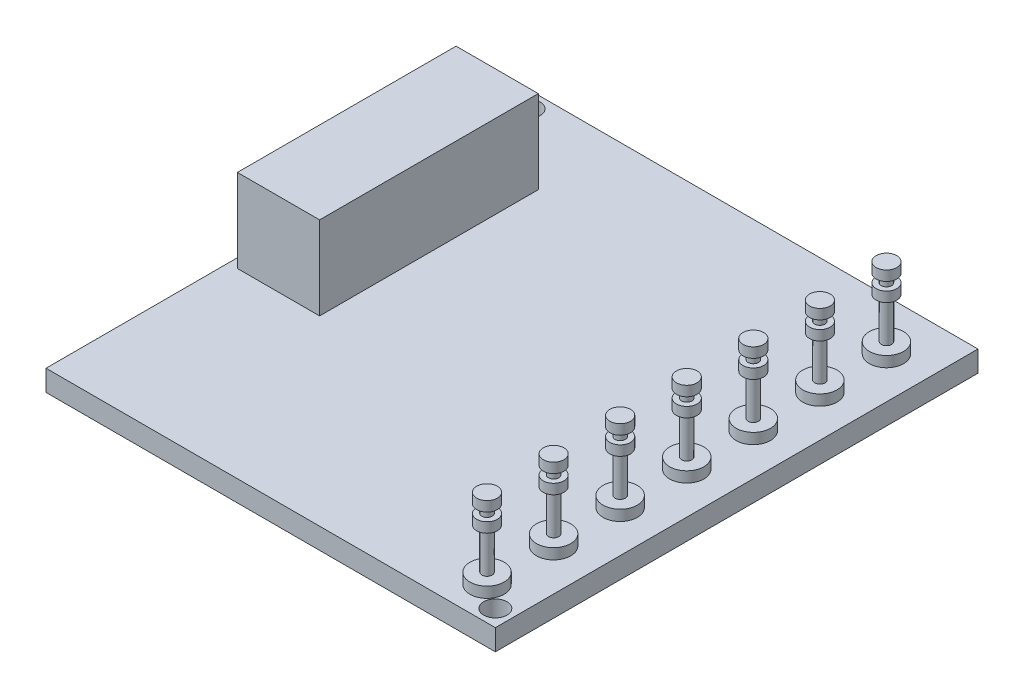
from build123d import *

# Parameters (mm, degrees)
SKETCH1_W                  = 34.29
SKETCH1_H                  = 36.83
BOSS_EXTRUDE1_DEPTH        = 1.6002
SKETCH2_W                  = 6.2738
SKETCH2_H                  = 16.6878
BOSS_EXTRUDE2_DEPTH        = 6.35
SKETCH3_R                  = 0.32766
BOSS_EXTRUDE3_DEPTH        = 1.4732
F_50_0_07_DIAMETER_HOLE1_D = 1.778
LPATTERN1_COUNT            = 7
LPATTERN1_PITCH            = 5.08


with BuildPart() as part:
    # Sketch1 → Boss-Extrude1 (new body)
    with BuildSketch(Plane(origin=(0, 0, 0), x_dir=(1, 0, 0), z_dir=(0, 1, 0))):
        Rectangle(SKETCH1_W, SKETCH1_H)
    extrude(amount=BOSS_EXTRUDE1_DEPTH)

    # Sketch2 → Boss-Extrude2 (add)
    with BuildSketch(Plane(origin=(0, 1.6002, 0), x_dir=(1, 0, 0), z_dir=(0, 1, 0))):
        with Locations((-13.2969, 3.8227)):
            Rectangle(SKETCH2_W, SKETCH2_H)
    extrude(amount=BOSS_EXTRUDE2_DEPTH)

    # Sketch3 → Boss-Extrude3 (add)
    with BuildSketch(Plane.XZ):
        with Locations(Location((-10.627365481, -5.990493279, 0), (0, 0, 270))):
            Circle(SKETCH3_R)
    extrude(amount=BOSS_EXTRUDE3_DEPTH)

    # 50 _0.07_ Diameter Hole1 (through all)
    with Locations(Plane(origin=(0, 1.6002, 0), x_dir=(1, 0, 0), z_dir=(0, 1, 0))):
        with Locations((-15.875, 17.145), (15.875, -17.145)):
            Hole(F_50_0_07_DIAMETER_HOLE1_D / 2)

    # Sketch6 → Revolve1 (revolve)
    with BuildSketch(Plane(origin=(13.97, 0, 0), x_dir=(0, 0, -1), z_dir=(1, 0, 0)), mode=Mode.PRIVATE) as revolve1_sk:
        Polygon((-15.875, 1.6002), (-17.1831, 1.6002), (-17.1831, 2.413), (-16.2687, 2.413), (-16.2687, 5.5372), (-16.6624, 5.5372), (-16.6624, 6.2992), (-16.2687, 6.2992), (-16.2687, 6.9342), (-16.6624, 6.9342), (-16.6624, 7.6962), (-15.875, 7.6962), align=None)
    revolve1 = revolve(revolve1_sk.sketch.rotate(Axis((13.97, 1.6002, 15.875), (0, 1, 0)), 180), axis=Axis((13.97, 1.6002, 15.875), (0, 1, 0)))

    # LPattern1: Revolve1 ×7
    with Locations(*[(0, 0, -i * LPATTERN1_PITCH) for i in range(1, LPATTERN1_COUNT)]):
        add(revolve1)


solid = part.part
